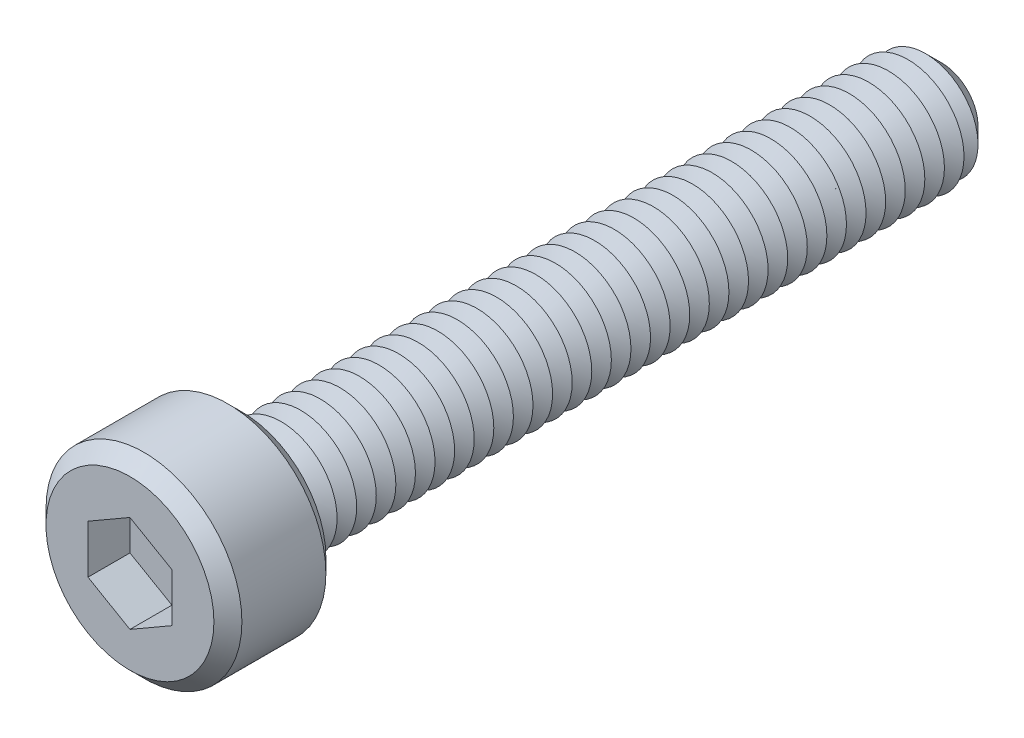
from build123d import *

# Parameters (mm, degrees)
SKETCH1_R           = 3.5
BOSS_EXTRUDE1_DEPTH = 4
SKETCH2_R           = 2
BOSS_EXTRUDE2_DEPTH = 25
CHAMFER1_SIZE       = 0.7
LPATTERN1_COUNT     = 35
LPATTERN1_PITCH     = 0.7
CUT_EXTRUDE1_DEPTH  = 1.5
SKETCH6_R           = 0.5
CUT_EXTRUDE2_DEPTH  = 27.5
CHAMFER2_SIZE       = 0.5


with BuildPart() as part:
    # Sketch1 → Boss-Extrude1 (new body)
    with BuildSketch(Plane.XY):
        Circle(SKETCH1_R)
    extrude(amount=BOSS_EXTRUDE1_DEPTH)

    # Sketch2 → Boss-Extrude2 (add)
    with BuildSketch(Plane(origin=(0, 0, 0), x_dir=(-1, 0, 0), z_dir=(0, 0, -1))):
        Circle(SKETCH2_R)
    extrude(amount=BOSS_EXTRUDE2_DEPTH)

    # Chamfer1
    chamfer1_edges = [part.edges().sort_by_distance(p)[0] for p in [
        (2, 0, -25),
    ]]
    chamfer(chamfer1_edges, length=CHAMFER1_SIZE)

    # Sketch4 → Cut-Revolve1 (revolve, cut)
    with BuildSketch(Plane(origin=(0, 0, 0), x_dir=(0, 0, -1), z_dir=(1, 0, 0)), mode=Mode.PRIVATE) as cut_revolve1_sk:
        Polygon((0, 2), (0.35, 1.393782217), (0.7, 2), align=None)
    cut_revolve1 = revolve(cut_revolve1_sk.sketch.rotate(Axis((0, 0, 2.512122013), (0, 0, -1)), 90), axis=Axis((0, 0, 2.512122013), (0, 0, -1)), mode=Mode.SUBTRACT)

    # LPattern1: Cut-Revolve1 ×35
    with Locations(*[(0, 0, -i * LPATTERN1_PITCH) for i in range(1, LPATTERN1_COUNT)]):
        add(cut_revolve1, mode=Mode.SUBTRACT)

    # Sketch5 → Cut-Extrude1 (cut)
    with BuildSketch(Plane.XY.offset(4)):
        Polygon((0, 1.732050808), (-1.5, 0.866025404), (-1.5, -0.866025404), (0, -1.732050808), (1.5, -0.866025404), (1.5, 0.866025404), align=None)
    extrude(amount=-CUT_EXTRUDE1_DEPTH, mode=Mode.SUBTRACT)

    # Sketch6 → Cut-Extrude2 (cut)
    with BuildSketch(Plane.XY.offset(2.5)):
        Circle(SKETCH6_R)
    extrude(amount=-CUT_EXTRUDE2_DEPTH, mode=Mode.SUBTRACT)

    # Chamfer2
    chamfer2_edges = [part.edges().sort_by_distance(p)[0] for p in [
        (-3.5, 0, 0),
        (-3.5, 0, 4),
    ]]
    chamfer(chamfer2_edges, length=CHAMFER2_SIZE)


solid = part.part
